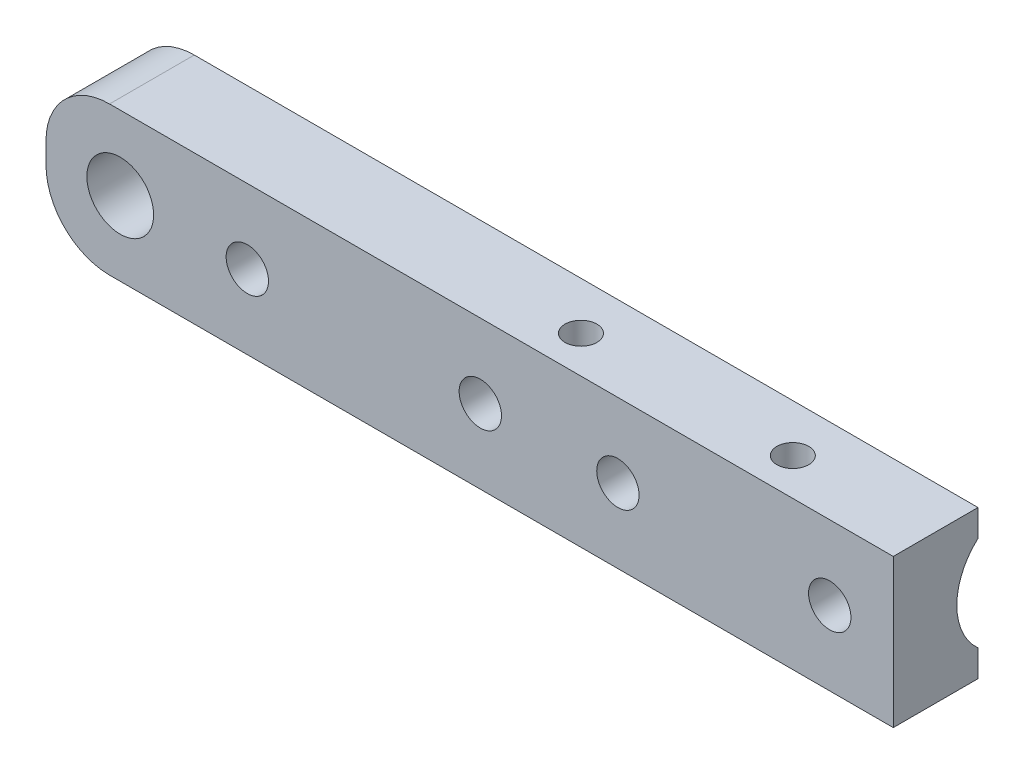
ISO-10303-21;
HEADER;
FILE_DESCRIPTION(('STEP AP214'),'2;1');
FILE_NAME('part.step','',(''),(''),'','','');
FILE_SCHEMA(('AUTOMOTIVE_DESIGN { 1 0 10303 214 1 1 1 1 }'));
ENDSEC;
DATA;
#1=APPLICATION_CONTEXT('core data for automotive mechanical design processes');
#2=APPLICATION_PROTOCOL_DEFINITION('international standard','automotive_design',2000,#1);
#3=PRODUCT_CONTEXT('',#1,'mechanical');
#4=PRODUCT('Part','Part','',(#3));
#5=PRODUCT_RELATED_PRODUCT_CATEGORY('part','',(#4));
#6=PRODUCT_DEFINITION_FORMATION('','',#4);
#7=PRODUCT_DEFINITION_CONTEXT('part definition',#1,'design');
#8=PRODUCT_DEFINITION('design','',#6,#7);
#9=PRODUCT_DEFINITION_SHAPE('','',#8);
#10=(LENGTH_UNIT() NAMED_UNIT(*) SI_UNIT(.MILLI.,.METRE.));
#11=(NAMED_UNIT(*) PLANE_ANGLE_UNIT() SI_UNIT($,.RADIAN.));
#12=(NAMED_UNIT(*) SI_UNIT($,.STERADIAN.) SOLID_ANGLE_UNIT());
#13=UNCERTAINTY_MEASURE_WITH_UNIT(LENGTH_MEASURE(1.E-05),#10,'distance_accuracy_value','');
#14=(GEOMETRIC_REPRESENTATION_CONTEXT(3) GLOBAL_UNCERTAINTY_ASSIGNED_CONTEXT((#13)) GLOBAL_UNIT_ASSIGNED_CONTEXT((#10,
#11,#12)) REPRESENTATION_CONTEXT('',''));
#15=CARTESIAN_POINT('',(0.,0.,0.));
#16=DIRECTION('',(0.,0.,1.));
#17=DIRECTION('',(1.,0.,0.));
#18=AXIS2_PLACEMENT_3D('',#15,#16,#17);
#19=CARTESIAN_POINT('',(-11.1252,-11.1125,6.35));
#20=DIRECTION('',(0.,1.,0.));
#21=DIRECTION('',(0.,0.,1.));
#22=AXIS2_PLACEMENT_3D('',#19,#20,#21);
#23=PLANE('',#22);
#24=CARTESIAN_POINT('',(63.5,-11.1125,0.7874));
#25=DIRECTION('',(0.,1.,0.));
#26=DIRECTION('',(0.,0.,1.));
#27=AXIS2_PLACEMENT_3D('',#24,#25,#26);
#28=CIRCLE('',#27,2.38760000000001);
#29=CARTESIAN_POINT('',(63.5,-11.1125,3.17500000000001));
#30=VERTEX_POINT('',#29);
#31=EDGE_CURVE('E260',#30,#30,#28,.F.);
#32=ORIENTED_EDGE('',*,*,#31,.F.);
#33=EDGE_LOOP('',(#32));
#34=FACE_BOUND('',#33,.T.);
#35=DIRECTION('',(1.,0.,0.));
#36=VECTOR('',#35,1.);
#37=CARTESIAN_POINT('',(-11.1252,-11.1125,6.35));
#38=LINE('',#37,#36);
#39=CARTESIAN_POINT('',(-1.6002,-11.1125,6.35));
#40=VERTEX_POINT('',#39);
#41=CARTESIAN_POINT('',(115.8748,-11.1125,6.35));
#42=VERTEX_POINT('',#41);
#43=EDGE_CURVE('E153',#40,#42,#38,.T.);
#44=ORIENTED_EDGE('',*,*,#43,.F.);
#45=DIRECTION('',(0.,0.,-1.));
#46=VECTOR('',#45,1.);
#47=CARTESIAN_POINT('',(-1.6002,-11.1125,6.35));
#48=LINE('',#47,#46);
#49=CARTESIAN_POINT('',(-1.6002,-11.1125,-6.35));
#50=VERTEX_POINT('',#49);
#51=EDGE_CURVE('E174',#40,#50,#48,.T.);
#52=ORIENTED_EDGE('',*,*,#51,.T.);
#53=DIRECTION('',(1.,0.,0.));
#54=VECTOR('',#53,1.);
#55=CARTESIAN_POINT('',(-11.1252,-11.1125,-6.35));
#56=LINE('',#55,#54);
#57=CARTESIAN_POINT('',(115.8748,-11.1125,-6.35));
#58=VERTEX_POINT('',#57);
#59=EDGE_CURVE('E163',#50,#58,#56,.T.);
#60=ORIENTED_EDGE('',*,*,#59,.T.);
#61=DIRECTION('',(0.,0.,-1.));
#62=VECTOR('',#61,1.);
#63=CARTESIAN_POINT('',(115.8748,-11.1125,6.35));
#64=LINE('',#63,#62);
#65=EDGE_CURVE('E171',#42,#58,#64,.T.);
#66=ORIENTED_EDGE('',*,*,#65,.F.);
#67=EDGE_LOOP('',(#44,#52,#60,#66));
#68=FACE_BOUND('',#67,.T.);
#69=CARTESIAN_POINT('',(95.25,-11.1125,0.7874));
#70=DIRECTION('',(0.,1.,0.));
#71=DIRECTION('',(0.,0.,1.));
#72=AXIS2_PLACEMENT_3D('',#69,#70,#71);
#73=CIRCLE('',#72,2.38760000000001);
#74=CARTESIAN_POINT('',(95.25,-11.1125,3.17500000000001));
#75=VERTEX_POINT('',#74);
#76=EDGE_CURVE('E265',#75,#75,#73,.F.);
#77=ORIENTED_EDGE('',*,*,#76,.F.);
#78=EDGE_LOOP('',(#77));
#79=FACE_BOUND('',#78,.T.);
#80=ADVANCED_FACE('F32',(#34,#68,#79),#23,.F.);
#81=CARTESIAN_POINT('',(115.8748,11.1125,6.35));
#82=DIRECTION('',(0.,-1.,0.));
#83=DIRECTION('',(0.,0.,-1.));
#84=AXIS2_PLACEMENT_3D('',#81,#82,#83);
#85=PLANE('',#84);
#86=CARTESIAN_POINT('',(63.5,11.1125,0.7874));
#87=DIRECTION('',(0.,-1.,0.));
#88=DIRECTION('',(0.,0.,-1.));
#89=AXIS2_PLACEMENT_3D('',#86,#87,#88);
#90=CIRCLE('',#89,2.38760000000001);
#91=CARTESIAN_POINT('',(63.5,11.1125,-1.60020000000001));
#92=VERTEX_POINT('',#91);
#93=EDGE_CURVE('E262',#92,#92,#90,.F.);
#94=ORIENTED_EDGE('',*,*,#93,.F.);
#95=EDGE_LOOP('',(#94));
#96=FACE_BOUND('',#95,.T.);
#97=DIRECTION('',(-1.,0.,0.));
#98=VECTOR('',#97,1.);
#99=CARTESIAN_POINT('',(115.8748,11.1125,-6.35));
#100=LINE('',#99,#98);
#101=CARTESIAN_POINT('',(115.8748,11.1125,-6.35));
#102=VERTEX_POINT('',#101);
#103=CARTESIAN_POINT('',(-1.6002,11.1125,-6.35));
#104=VERTEX_POINT('',#103);
#105=EDGE_CURVE('E154',#102,#104,#100,.T.);
#106=ORIENTED_EDGE('',*,*,#105,.T.);
#107=DIRECTION('',(0.,0.,-1.));
#108=VECTOR('',#107,1.);
#109=CARTESIAN_POINT('',(-1.6002,11.1125,6.35));
#110=LINE('',#109,#108);
#111=CARTESIAN_POINT('',(-1.6002,11.1125,6.35));
#112=VERTEX_POINT('',#111);
#113=EDGE_CURVE('E41',#104,#112,#110,.F.);
#114=ORIENTED_EDGE('',*,*,#113,.T.);
#115=DIRECTION('',(-1.,0.,0.));
#116=VECTOR('',#115,1.);
#117=CARTESIAN_POINT('',(115.8748,11.1125,6.35));
#118=LINE('',#117,#116);
#119=CARTESIAN_POINT('',(115.8748,11.1125,6.35));
#120=VERTEX_POINT('',#119);
#121=EDGE_CURVE('E158',#120,#112,#118,.T.);
#122=ORIENTED_EDGE('',*,*,#121,.F.);
#123=DIRECTION('',(0.,0.,-1.));
#124=VECTOR('',#123,1.);
#125=CARTESIAN_POINT('',(115.8748,11.1125,6.35));
#126=LINE('',#125,#124);
#127=EDGE_CURVE('E160',#120,#102,#126,.T.);
#128=ORIENTED_EDGE('',*,*,#127,.T.);
#129=EDGE_LOOP('',(#106,#114,#122,#128));
#130=FACE_BOUND('',#129,.T.);
#131=CARTESIAN_POINT('',(95.25,11.1125,0.7874));
#132=DIRECTION('',(0.,-1.,0.));
#133=DIRECTION('',(0.,0.,-1.));
#134=AXIS2_PLACEMENT_3D('',#131,#132,#133);
#135=CIRCLE('',#134,2.38760000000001);
#136=CARTESIAN_POINT('',(95.25,11.1125,-1.60020000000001));
#137=VERTEX_POINT('',#136);
#138=EDGE_CURVE('E36',#137,#137,#135,.F.);
#139=ORIENTED_EDGE('',*,*,#138,.F.);
#140=EDGE_LOOP('',(#139));
#141=FACE_BOUND('',#140,.T.);
#142=ADVANCED_FACE('F220',(#96,#130,#141),#85,.F.);
#143=CARTESIAN_POINT('',(0.,0.,6.35));
#144=DIRECTION('',(0.,0.,1.));
#145=DIRECTION('',(1.,0.,0.));
#146=AXIS2_PLACEMENT_3D('',#143,#144,#145);
#147=PLANE('',#146);
#148=CARTESIAN_POINT('',(19.05,0.,6.35));
#149=DIRECTION('',(0.,0.,1.));
#150=DIRECTION('',(1.,0.,0.));
#151=AXIS2_PLACEMENT_3D('',#148,#149,#150);
#152=CIRCLE('',#151,3.175);
#153=CARTESIAN_POINT('',(22.225,0.,6.35));
#154=VERTEX_POINT('',#153);
#155=EDGE_CURVE('E132',#154,#154,#152,.T.);
#156=ORIENTED_EDGE('',*,*,#155,.F.);
#157=EDGE_LOOP('',(#156));
#158=FACE_BOUND('',#157,.T.);
#159=CARTESIAN_POINT('',(106.3498,0.,6.35));
#160=DIRECTION('',(0.,0.,1.));
#161=DIRECTION('',(1.,0.,0.));
#162=AXIS2_PLACEMENT_3D('',#159,#160,#161);
#163=CIRCLE('',#162,3.175);
#164=CARTESIAN_POINT('',(109.5248,0.,6.35));
#165=VERTEX_POINT('',#164);
#166=EDGE_CURVE('E140',#165,#165,#163,.T.);
#167=ORIENTED_EDGE('',*,*,#166,.F.);
#168=EDGE_LOOP('',(#167));
#169=FACE_BOUND('',#168,.T.);
#170=DIRECTION('',(0.,-1.,0.));
#171=VECTOR('',#170,1.);
#172=CARTESIAN_POINT('',(-11.1252,11.1125,6.35));
#173=LINE('',#172,#171);
#174=CARTESIAN_POINT('',(-11.1252,1.5875,6.35));
#175=VERTEX_POINT('',#174);
#176=CARTESIAN_POINT('',(-11.1252,-1.5875,6.35));
#177=VERTEX_POINT('',#176);
#178=EDGE_CURVE('E150',#175,#177,#173,.T.);
#179=ORIENTED_EDGE('',*,*,#178,.T.);
#180=CARTESIAN_POINT('',(-1.6002,-1.5875,6.35));
#181=DIRECTION('',(0.,0.,1.));
#182=DIRECTION('',(1.,0.,0.));
#183=AXIS2_PLACEMENT_3D('',#180,#181,#182);
#184=CIRCLE('',#183,9.525);
#185=EDGE_CURVE('E188',#177,#40,#184,.T.);
#186=ORIENTED_EDGE('',*,*,#185,.T.);
#187=ORIENTED_EDGE('',*,*,#43,.T.);
#188=DIRECTION('',(0.,1.,0.));
#189=VECTOR('',#188,1.);
#190=CARTESIAN_POINT('',(115.8748,-11.1125,6.35));
#191=LINE('',#190,#189);
#192=EDGE_CURVE('E156',#42,#120,#191,.T.);
#193=ORIENTED_EDGE('',*,*,#192,.T.);
#194=ORIENTED_EDGE('',*,*,#121,.T.);
#195=CARTESIAN_POINT('',(-1.6002,1.5875,6.35));
#196=DIRECTION('',(0.,0.,1.));
#197=DIRECTION('',(1.,0.,0.));
#198=AXIS2_PLACEMENT_3D('',#195,#196,#197);
#199=CIRCLE('',#198,9.525);
#200=EDGE_CURVE('E186',#112,#175,#199,.T.);
#201=ORIENTED_EDGE('',*,*,#200,.T.);
#202=EDGE_LOOP('',(#179,#186,#187,#193,#194,#201));
#203=FACE_BOUND('',#202,.T.);
#204=CARTESIAN_POINT('',(0.,0.,6.35));
#205=DIRECTION('',(0.,0.,1.));
#206=DIRECTION('',(1.,0.,0.));
#207=AXIS2_PLACEMENT_3D('',#204,#205,#206);
#208=CIRCLE('',#207,5.0038);
#209=CARTESIAN_POINT('',(5.0038,0.,6.35));
#210=VERTEX_POINT('',#209);
#211=EDGE_CURVE('E144',#210,#210,#208,.T.);
#212=ORIENTED_EDGE('',*,*,#211,.F.);
#213=EDGE_LOOP('',(#212));
#214=FACE_BOUND('',#213,.T.);
#215=CARTESIAN_POINT('',(74.5998,0.,6.35));
#216=DIRECTION('',(0.,0.,1.));
#217=DIRECTION('',(1.,0.,0.));
#218=AXIS2_PLACEMENT_3D('',#215,#216,#217);
#219=CIRCLE('',#218,3.17500000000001);
#220=CARTESIAN_POINT('',(77.7748,0.,6.35));
#221=VERTEX_POINT('',#220);
#222=EDGE_CURVE('E135',#221,#221,#219,.T.);
#223=ORIENTED_EDGE('',*,*,#222,.F.);
#224=EDGE_LOOP('',(#223));
#225=FACE_BOUND('',#224,.T.);
#226=CARTESIAN_POINT('',(53.975,0.,6.35));
#227=DIRECTION('',(0.,0.,1.));
#228=DIRECTION('',(1.,0.,0.));
#229=AXIS2_PLACEMENT_3D('',#226,#227,#228);
#230=CIRCLE('',#229,3.175);
#231=CARTESIAN_POINT('',(57.15,0.,6.35));
#232=VERTEX_POINT('',#231);
#233=EDGE_CURVE('E126',#232,#232,#230,.T.);
#234=ORIENTED_EDGE('',*,*,#233,.F.);
#235=EDGE_LOOP('',(#234));
#236=FACE_BOUND('',#235,.T.);
#237=ADVANCED_FACE('F226',(#158,#169,#203,#214,#225,#236),#147,.T.);
#238=CARTESIAN_POINT('',(0.,0.,-6.35));
#239=DIRECTION('',(0.,0.,1.));
#240=DIRECTION('',(1.,0.,0.));
#241=AXIS2_PLACEMENT_3D('',#238,#239,#240);
#242=PLANE('',#241);
#243=CARTESIAN_POINT('',(19.05,0.,-6.35));
#244=DIRECTION('',(0.,0.,1.));
#245=DIRECTION('',(1.,0.,0.));
#246=AXIS2_PLACEMENT_3D('',#243,#244,#245);
#247=CIRCLE('',#246,3.175);
#248=CARTESIAN_POINT('',(22.225,0.,-6.35));
#249=VERTEX_POINT('',#248);
#250=EDGE_CURVE('E129',#249,#249,#247,.T.);
#251=ORIENTED_EDGE('',*,*,#250,.T.);
#252=EDGE_LOOP('',(#251));
#253=FACE_BOUND('',#252,.T.);
#254=DIRECTION('',(0.,1.,0.));
#255=VECTOR('',#254,1.);
#256=CARTESIAN_POINT('',(65.0748,0.,-6.35));
#257=LINE('',#256,#255);
#258=CARTESIAN_POINT('',(65.0748,-7.09951582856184,-6.35));
#259=VERTEX_POINT('',#258);
#260=CARTESIAN_POINT('',(65.0748,7.09951582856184,-6.35));
#261=VERTEX_POINT('',#260);
#262=EDGE_CURVE('E11',#259,#261,#257,.T.);
#263=ORIENTED_EDGE('',*,*,#262,.F.);
#264=DIRECTION('',(1.,0.,0.));
#265=VECTOR('',#264,1.);
#266=CARTESIAN_POINT('',(65.0748,-7.09951582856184,-6.35));
#267=LINE('',#266,#265);
#268=CARTESIAN_POINT('',(115.8748,-7.09951582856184,-6.35));
#269=VERTEX_POINT('',#268);
#270=EDGE_CURVE('E105',#259,#269,#267,.T.);
#271=ORIENTED_EDGE('',*,*,#270,.T.);
#272=DIRECTION('',(0.,1.,0.));
#273=VECTOR('',#272,1.);
#274=CARTESIAN_POINT('',(115.8748,-11.1125,-6.35));
#275=LINE('',#274,#273);
#276=EDGE_CURVE('E165',#58,#269,#275,.T.);
#277=ORIENTED_EDGE('',*,*,#276,.F.);
#278=ORIENTED_EDGE('',*,*,#59,.F.);
#279=CARTESIAN_POINT('',(-1.6002,-1.5875,-6.35));
#280=DIRECTION('',(0.,0.,1.));
#281=DIRECTION('',(1.,0.,0.));
#282=AXIS2_PLACEMENT_3D('',#279,#280,#281);
#283=CIRCLE('',#282,9.525);
#284=CARTESIAN_POINT('',(-11.1252,-1.5875,-6.35));
#285=VERTEX_POINT('',#284);
#286=EDGE_CURVE('E179',#50,#285,#283,.F.);
#287=ORIENTED_EDGE('',*,*,#286,.T.);
#288=DIRECTION('',(0.,-1.,0.));
#289=VECTOR('',#288,1.);
#290=CARTESIAN_POINT('',(-11.1252,11.1125,-6.35));
#291=LINE('',#290,#289);
#292=CARTESIAN_POINT('',(-11.1252,1.5875,-6.35));
#293=VERTEX_POINT('',#292);
#294=EDGE_CURVE('E147',#293,#285,#291,.T.);
#295=ORIENTED_EDGE('',*,*,#294,.F.);
#296=CARTESIAN_POINT('',(-1.6002,1.5875,-6.35));
#297=DIRECTION('',(0.,0.,1.));
#298=DIRECTION('',(1.,0.,0.));
#299=AXIS2_PLACEMENT_3D('',#296,#297,#298);
#300=CIRCLE('',#299,9.525);
#301=EDGE_CURVE('E177',#293,#104,#300,.F.);
#302=ORIENTED_EDGE('',*,*,#301,.T.);
#303=ORIENTED_EDGE('',*,*,#105,.F.);
#304=CARTESIAN_POINT('',(115.8748,7.09951582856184,-6.35));
#305=VERTEX_POINT('',#304);
#306=EDGE_CURVE('E113',#305,#102,#275,.T.);
#307=ORIENTED_EDGE('',*,*,#306,.F.);
#308=DIRECTION('',(1.,0.,0.));
#309=VECTOR('',#308,1.);
#310=CARTESIAN_POINT('',(65.0748,7.09951582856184,-6.35));
#311=LINE('',#310,#309);
#312=EDGE_CURVE('E49',#305,#261,#311,.F.);
#313=ORIENTED_EDGE('',*,*,#312,.T.);
#314=EDGE_LOOP('',(#263,#271,#277,#278,#287,#295,#302,#303,#307,#313));
#315=FACE_BOUND('',#314,.T.);
#316=CARTESIAN_POINT('',(0.,0.,-6.35));
#317=DIRECTION('',(0.,0.,1.));
#318=DIRECTION('',(1.,0.,0.));
#319=AXIS2_PLACEMENT_3D('',#316,#317,#318);
#320=CIRCLE('',#319,5.0038);
#321=CARTESIAN_POINT('',(5.0038,0.,-6.35));
#322=VERTEX_POINT('',#321);
#323=EDGE_CURVE('E143',#322,#322,#320,.T.);
#324=ORIENTED_EDGE('',*,*,#323,.T.);
#325=EDGE_LOOP('',(#324));
#326=FACE_BOUND('',#325,.T.);
#327=CARTESIAN_POINT('',(53.975,0.,-6.35));
#328=DIRECTION('',(0.,0.,1.));
#329=DIRECTION('',(1.,0.,0.));
#330=AXIS2_PLACEMENT_3D('',#327,#328,#329);
#331=CIRCLE('',#330,3.175);
#332=CARTESIAN_POINT('',(57.15,0.,-6.35));
#333=VERTEX_POINT('',#332);
#334=EDGE_CURVE('E116',#333,#333,#331,.T.);
#335=ORIENTED_EDGE('',*,*,#334,.T.);
#336=EDGE_LOOP('',(#335));
#337=FACE_BOUND('',#336,.T.);
#338=ADVANCED_FACE('F110',(#253,#315,#326,#337),#242,.F.);
#339=CARTESIAN_POINT('',(-11.1252,11.1125,6.35));
#340=DIRECTION('',(1.,0.,0.));
#341=DIRECTION('',(0.,0.,-1.));
#342=AXIS2_PLACEMENT_3D('',#339,#340,#341);
#343=PLANE('',#342);
#344=ORIENTED_EDGE('',*,*,#294,.T.);
#345=DIRECTION('',(0.,0.,-1.));
#346=VECTOR('',#345,1.);
#347=CARTESIAN_POINT('',(-11.1252,-1.5875,6.35));
#348=LINE('',#347,#346);
#349=EDGE_CURVE('E184',#285,#177,#348,.F.);
#350=ORIENTED_EDGE('',*,*,#349,.T.);
#351=ORIENTED_EDGE('',*,*,#178,.F.);
#352=DIRECTION('',(0.,0.,-1.));
#353=VECTOR('',#352,1.);
#354=CARTESIAN_POINT('',(-11.1252,1.5875,6.35));
#355=LINE('',#354,#353);
#356=EDGE_CURVE('E181',#175,#293,#355,.T.);
#357=ORIENTED_EDGE('',*,*,#356,.T.);
#358=EDGE_LOOP('',(#344,#350,#351,#357));
#359=FACE_BOUND('',#358,.T.);
#360=ADVANCED_FACE('F234',(#359),#343,.F.);
#361=CARTESIAN_POINT('',(115.8748,-11.1125,6.35));
#362=DIRECTION('',(-1.,0.,0.));
#363=DIRECTION('',(0.,0.,1.));
#364=AXIS2_PLACEMENT_3D('',#361,#362,#363);
#365=PLANE('',#364);
#366=ORIENTED_EDGE('',*,*,#276,.T.);
#367=CARTESIAN_POINT('',(115.8748,0.,-12.7));
#368=DIRECTION('',(1.,0.,0.));
#369=DIRECTION('',(0.,0.,-1.));
#370=AXIS2_PLACEMENT_3D('',#367,#368,#369);
#371=CIRCLE('',#370,9.525);
#372=EDGE_CURVE('E107',#305,#269,#371,.T.);
#373=ORIENTED_EDGE('',*,*,#372,.F.);
#374=ORIENTED_EDGE('',*,*,#306,.T.);
#375=ORIENTED_EDGE('',*,*,#127,.F.);
#376=ORIENTED_EDGE('',*,*,#192,.F.);
#377=ORIENTED_EDGE('',*,*,#65,.T.);
#378=EDGE_LOOP('',(#366,#373,#374,#375,#376,#377));
#379=FACE_BOUND('',#378,.T.);
#380=ADVANCED_FACE('F233',(#379),#365,.F.);
#381=CARTESIAN_POINT('',(0.,0.,6.35));
#382=DIRECTION('',(0.,0.,-1.));
#383=DIRECTION('',(-1.,0.,0.));
#384=AXIS2_PLACEMENT_3D('',#381,#382,#383);
#385=CYLINDRICAL_SURFACE('',#384,5.0038);
#386=ORIENTED_EDGE('',*,*,#211,.T.);
#387=EDGE_LOOP('',(#386));
#388=FACE_BOUND('',#387,.T.);
#389=ORIENTED_EDGE('',*,*,#323,.F.);
#390=EDGE_LOOP('',(#389));
#391=FACE_BOUND('',#390,.T.);
#392=ADVANCED_FACE('F324',(#388,#391),#385,.F.);
#393=CARTESIAN_POINT('',(106.3498,0.,6.35));
#394=DIRECTION('',(0.,0.,-1.));
#395=DIRECTION('',(-1.,0.,0.));
#396=AXIS2_PLACEMENT_3D('',#393,#394,#395);
#397=CYLINDRICAL_SURFACE('',#396,3.175);
#398=CARTESIAN_POINT('',(103.1748,0.,-3.17499999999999));
#399=CARTESIAN_POINT('',(103.174799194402,-0.173238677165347,-3.17499951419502));
#400=CARTESIAN_POINT('',(103.189024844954,-0.346472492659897,-3.17976981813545));
#401=CARTESIAN_POINT('',(103.245377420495,-0.687837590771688,-3.19832957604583));
#402=CARTESIAN_POINT('',(103.287507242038,-0.855968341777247,-3.21211996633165));
#403=CARTESIAN_POINT('',(103.398063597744,-1.18215660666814,-3.24722147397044));
#404=CARTESIAN_POINT('',(103.466446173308,-1.34023044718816,-3.2685200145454));
#405=CARTESIAN_POINT('',(103.627368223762,-1.64266542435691,-3.31646384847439));
#406=CARTESIAN_POINT('',(103.719912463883,-1.78702384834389,-3.34311019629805));
#407=CARTESIAN_POINT('',(103.929896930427,-2.0629298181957,-3.39997750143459));
#408=CARTESIAN_POINT('',(104.048024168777,-2.19393674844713,-3.43028408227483));
#409=CARTESIAN_POINT('',(104.304360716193,-2.43469379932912,-3.49058500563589));
#410=CARTESIAN_POINT('',(104.442574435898,-2.54443923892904,-3.52057927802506));
#411=CARTESIAN_POINT('',(104.740027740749,-2.74264419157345,-3.57780169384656));
#412=CARTESIAN_POINT('',(104.899757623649,-2.83040092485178,-3.6049255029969));
#413=CARTESIAN_POINT('',(105.232759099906,-2.97757492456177,-3.65203405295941));
#414=CARTESIAN_POINT('',(105.406026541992,-3.03700083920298,-3.67202097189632));
#415=CARTESIAN_POINT('',(105.755037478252,-3.12379824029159,-3.70169112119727));
#416=CARTESIAN_POINT('',(105.930500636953,-3.15218269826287,-3.71169895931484));
#417=CARTESIAN_POINT('',(106.283962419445,-3.17925806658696,-3.72123790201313));
#418=CARTESIAN_POINT('',(106.461960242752,-3.17795815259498,-3.72077224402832));
#419=CARTESIAN_POINT('',(106.80679880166,-3.14648819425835,-3.70970127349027));
#420=CARTESIAN_POINT('',(106.973777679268,-3.11764017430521,-3.69956029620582));
#421=CARTESIAN_POINT('',(107.300374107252,-3.0340495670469,-3.6710411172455));
#422=CARTESIAN_POINT('',(107.459990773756,-2.97930387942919,-3.65266192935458));
#423=CARTESIAN_POINT('',(107.770335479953,-2.84460650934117,-3.60940632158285));
#424=CARTESIAN_POINT('',(107.920878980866,-2.76426310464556,-3.58443003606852));
#425=CARTESIAN_POINT('',(108.206765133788,-2.58092291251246,-3.53083626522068));
#426=CARTESIAN_POINT('',(108.342103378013,-2.47791958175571,-3.50221772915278));
#427=CARTESIAN_POINT('',(108.60116582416,-2.2458341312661,-3.44273729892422));
#428=CARTESIAN_POINT('',(108.723914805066,-2.11567125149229,-3.41183628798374));
#429=CARTESIAN_POINT('',(108.946096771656,-1.83622813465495,-3.35257970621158));
#430=CARTESIAN_POINT('',(109.045527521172,-1.68694606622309,-3.32422437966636));
#431=CARTESIAN_POINT('',(109.219035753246,-1.3714336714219,-3.27288182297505));
#432=CARTESIAN_POINT('',(109.292851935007,-1.20504990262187,-3.24995063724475));
#433=CARTESIAN_POINT('',(109.411145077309,-0.861279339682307,-3.21244699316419));
#434=CARTESIAN_POINT('',(109.455632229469,-0.683896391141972,-3.19787163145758));
#435=CARTESIAN_POINT('',(109.512276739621,-0.331418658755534,-3.17920284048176));
#436=CARTESIAN_POINT('',(109.525751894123,-0.156557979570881,-3.17468244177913));
#437=CARTESIAN_POINT('',(109.523743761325,0.192960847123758,-3.17535233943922));
#438=CARTESIAN_POINT('',(109.508265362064,0.367619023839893,-3.18054099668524));
#439=CARTESIAN_POINT('',(109.449832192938,0.706500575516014,-3.19976421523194));
#440=CARTESIAN_POINT('',(109.407686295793,0.870879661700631,-3.21353819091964));
#441=CARTESIAN_POINT('',(109.298125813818,1.19016766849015,-3.24828386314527));
#442=CARTESIAN_POINT('',(109.23070800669,1.34507537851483,-3.26925647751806));
#443=CARTESIAN_POINT('',(109.070551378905,1.64556534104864,-3.31695643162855));
#444=CARTESIAN_POINT('',(108.977193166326,1.79079512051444,-3.34382063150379));
#445=CARTESIAN_POINT('',(108.768533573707,2.06395583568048,-3.40025818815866));
#446=CARTESIAN_POINT('',(108.653225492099,2.19188146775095,-3.42983237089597));
#447=CARTESIAN_POINT('',(108.397742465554,2.432851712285,-3.49006007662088));
#448=CARTESIAN_POINT('',(108.256675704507,2.54495607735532,-3.52070158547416));
#449=CARTESIAN_POINT('',(107.9570752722,2.74401763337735,-3.578225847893));
#450=CARTESIAN_POINT('',(107.798541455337,2.83097461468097,-3.60510857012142));
#451=CARTESIAN_POINT('',(107.468438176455,2.97687025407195,-3.65180906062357));
#452=CARTESIAN_POINT('',(107.296895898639,3.03586556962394,-3.67164109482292));
#453=CARTESIAN_POINT('',(106.94549778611,3.12386556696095,-3.70170607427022));
#454=CARTESIAN_POINT('',(106.765645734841,3.15288375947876,-3.71194334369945));
#455=CARTESIAN_POINT('',(106.41267422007,3.17905219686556,-3.72116798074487));
#456=CARTESIAN_POINT('',(106.239683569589,3.17776306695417,-3.72070629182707));
#457=CARTESIAN_POINT('',(105.896520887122,3.1471942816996,-3.70994718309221));
#458=CARTESIAN_POINT('',(105.726348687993,3.11791629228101,-3.69965034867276));
#459=CARTESIAN_POINT('',(105.396869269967,3.03330550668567,-3.67079135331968));
#460=CARTESIAN_POINT('',(105.237417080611,2.97847812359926,-3.65238988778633));
#461=CARTESIAN_POINT('',(104.929852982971,2.84473448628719,-3.60945433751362));
#462=CARTESIAN_POINT('',(104.781743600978,2.76581288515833,-3.58491889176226));
#463=CARTESIAN_POINT('',(104.494064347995,2.58210269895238,-3.53114517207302));
#464=CARTESIAN_POINT('',(104.355149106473,2.47633567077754,-3.50174840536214));
#465=CARTESIAN_POINT('',(104.096534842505,2.24359115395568,-3.44222843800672));
#466=CARTESIAN_POINT('',(103.97684127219,2.11660766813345,-3.41210503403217));
#467=CARTESIAN_POINT('',(103.755366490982,1.83909194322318,-3.35311653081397));
#468=CARTESIAN_POINT('',(103.654465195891,1.68783480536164,-3.3243462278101));
#469=CARTESIAN_POINT('',(103.479630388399,1.36955960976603,-3.27259978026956));
#470=CARTESIAN_POINT('',(103.405689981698,1.2025455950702,-3.24962215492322));
#471=CARTESIAN_POINT('',(103.289983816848,0.865167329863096,-3.21292489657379));
#472=CARTESIAN_POINT('',(103.246928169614,0.695286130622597,-3.1988375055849));
#473=CARTESIAN_POINT('',(103.18934060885,0.350267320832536,-3.17987657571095));
#474=CARTESIAN_POINT('',(103.174800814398,0.175131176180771,-3.17500049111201));
#475=CARTESIAN_POINT('',(103.1748,0.,-3.17499999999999));
#476=B_SPLINE_CURVE_WITH_KNOTS('',3,(#398,#399,#400,#401,#402,#403,#404,#405,#406,#407,#408,
#409,#410,#411,#412,#413,#414,#415,#416,#417,#418,#419,#420,#421,#422,#423,#424,#425,#426,#427,
#428,#429,#430,#431,#432,#433,#434,#435,#436,#437,#438,#439,#440,#441,#442,#443,#444,#445,#446,
#447,#448,#449,#450,#451,#452,#453,#454,#455,#456,#457,#458,#459,#460,#461,#462,#463,#464,#465,
#466,#467,#468,#469,#470,#471,#472,#473,#474,#475),.UNSPECIFIED.,.T.,.F.,(4,2,2,2,2,2,2,2,2,2,2,
2,2,2,2,2,2,2,2,2,2,2,2,2,2,2,2,2,2,2,2,2,2,2,2,2,2,2,4),(0.,0.519071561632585,1.03819701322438,
1.55645698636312,2.07481924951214,2.60936372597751,3.14402575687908,3.69406121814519,
4.24392866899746,4.77526114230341,5.30642937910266,5.81332424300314,6.32027980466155,
6.83539943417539,7.35066800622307,7.89283745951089,8.43505888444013,8.98265937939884,
9.53006948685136,10.0537512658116,10.5773446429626,11.0857715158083,11.5942632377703,
12.1161301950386,12.638156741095,13.1839024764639,13.7296527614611,14.274292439,
14.8186865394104,15.3351123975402,15.8515075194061,16.3580948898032,16.8647947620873,
17.3936046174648,17.92256420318,18.4721392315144,19.0215736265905,19.5464607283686,
20.0712027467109),.UNSPECIFIED.);
#477=CARTESIAN_POINT('',(103.1748,0.,-3.17499999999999));
#478=VERTEX_POINT('',#477);
#479=EDGE_CURVE('E114',#478,#478,#476,.T.);
#480=ORIENTED_EDGE('',*,*,#479,.F.);
#481=EDGE_LOOP('',(#480));
#482=FACE_BOUND('',#481,.T.);
#483=ORIENTED_EDGE('',*,*,#166,.T.);
#484=EDGE_LOOP('',(#483));
#485=FACE_BOUND('',#484,.T.);
#486=ADVANCED_FACE('F216',(#482,#485),#397,.F.);
#487=CARTESIAN_POINT('',(74.5998,0.,6.35));
#488=DIRECTION('',(0.,0.,-1.));
#489=DIRECTION('',(-1.,0.,0.));
#490=AXIS2_PLACEMENT_3D('',#487,#488,#489);
#491=CYLINDRICAL_SURFACE('',#490,3.17500000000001);
#492=CARTESIAN_POINT('',(71.4248,0.,-3.17499999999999));
#493=CARTESIAN_POINT('',(71.424799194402,-0.173238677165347,-3.17499951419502));
#494=CARTESIAN_POINT('',(71.4390248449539,-0.346472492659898,-3.17976981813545));
#495=CARTESIAN_POINT('',(71.4953774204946,-0.687837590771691,-3.19832957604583));
#496=CARTESIAN_POINT('',(71.5375072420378,-0.855968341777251,-3.21211996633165));
#497=CARTESIAN_POINT('',(71.6480635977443,-1.18215660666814,-3.24722147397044));
#498=CARTESIAN_POINT('',(71.7164461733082,-1.34023044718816,-3.2685200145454));
#499=CARTESIAN_POINT('',(71.8773682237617,-1.64266542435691,-3.31646384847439));
#500=CARTESIAN_POINT('',(71.9699124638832,-1.7870238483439,-3.34311019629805));
#501=CARTESIAN_POINT('',(72.1798969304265,-2.06292981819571,-3.39997750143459));
#502=CARTESIAN_POINT('',(72.298024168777,-2.19393674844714,-3.43028408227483));
#503=CARTESIAN_POINT('',(72.5543607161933,-2.43469379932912,-3.49058500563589));
#504=CARTESIAN_POINT('',(72.692574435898,-2.54443923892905,-3.52057927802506));
#505=CARTESIAN_POINT('',(72.9900277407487,-2.74264419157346,-3.57780169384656));
#506=CARTESIAN_POINT('',(73.1497576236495,-2.83040092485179,-3.6049255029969));
#507=CARTESIAN_POINT('',(73.4827590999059,-2.97757492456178,-3.65203405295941));
#508=CARTESIAN_POINT('',(73.6560265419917,-3.03700083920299,-3.67202097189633));
#509=CARTESIAN_POINT('',(74.005037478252,-3.12379824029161,-3.70169112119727));
#510=CARTESIAN_POINT('',(74.1805006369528,-3.15218269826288,-3.71169895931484));
#511=CARTESIAN_POINT('',(74.5339624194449,-3.17925806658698,-3.72123790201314));
#512=CARTESIAN_POINT('',(74.7119602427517,-3.17795815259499,-3.72077224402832));
#513=CARTESIAN_POINT('',(75.0567988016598,-3.14648819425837,-3.70970127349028));
#514=CARTESIAN_POINT('',(75.2237776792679,-3.11764017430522,-3.69956029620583));
#515=CARTESIAN_POINT('',(75.5503741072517,-3.03404956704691,-3.67104111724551));
#516=CARTESIAN_POINT('',(75.7099907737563,-2.9793038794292,-3.65266192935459));
#517=CARTESIAN_POINT('',(76.0203354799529,-2.84460650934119,-3.60940632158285));
#518=CARTESIAN_POINT('',(76.1708789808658,-2.76426310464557,-3.58443003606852));
#519=CARTESIAN_POINT('',(76.4567651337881,-2.58092291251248,-3.53083626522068));
#520=CARTESIAN_POINT('',(76.5921033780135,-2.47791958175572,-3.50221772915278));
#521=CARTESIAN_POINT('',(76.8511658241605,-2.2458341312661,-3.44273729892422));
#522=CARTESIAN_POINT('',(76.9739148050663,-2.11567125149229,-3.41183628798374));
#523=CARTESIAN_POINT('',(77.1960967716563,-1.83622813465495,-3.35257970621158));
#524=CARTESIAN_POINT('',(77.2955275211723,-1.68694606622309,-3.32422437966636));
#525=CARTESIAN_POINT('',(77.4690357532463,-1.3714336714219,-3.27288182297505));
#526=CARTESIAN_POINT('',(77.5428519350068,-1.20504990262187,-3.24995063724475));
#527=CARTESIAN_POINT('',(77.6611450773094,-0.861279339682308,-3.21244699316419));
#528=CARTESIAN_POINT('',(77.7056322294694,-0.683896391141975,-3.19787163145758));
#529=CARTESIAN_POINT('',(77.762276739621,-0.331418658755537,-3.17920284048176));
#530=CARTESIAN_POINT('',(77.7757518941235,-0.156557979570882,-3.17468244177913));
#531=CARTESIAN_POINT('',(77.7737437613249,0.192960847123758,-3.17535233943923));
#532=CARTESIAN_POINT('',(77.7582653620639,0.367619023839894,-3.18054099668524));
#533=CARTESIAN_POINT('',(77.6998321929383,0.706500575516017,-3.19976421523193));
#534=CARTESIAN_POINT('',(77.6576862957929,0.870879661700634,-3.21353819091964));
#535=CARTESIAN_POINT('',(77.5481258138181,1.19016766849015,-3.24828386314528));
#536=CARTESIAN_POINT('',(77.4807080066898,1.34507537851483,-3.26925647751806));
#537=CARTESIAN_POINT('',(77.3205513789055,1.64556534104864,-3.31695643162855));
#538=CARTESIAN_POINT('',(77.2271931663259,1.79079512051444,-3.34382063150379));
#539=CARTESIAN_POINT('',(77.0185335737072,2.06395583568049,-3.40025818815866));
#540=CARTESIAN_POINT('',(76.9032254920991,2.19188146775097,-3.42983237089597));
#541=CARTESIAN_POINT('',(76.6477424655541,2.43285171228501,-3.49006007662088));
#542=CARTESIAN_POINT('',(76.5066757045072,2.54495607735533,-3.52070158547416));
#543=CARTESIAN_POINT('',(76.2070752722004,2.74401763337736,-3.578225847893));
#544=CARTESIAN_POINT('',(76.0485414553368,2.83097461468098,-3.60510857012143));
#545=CARTESIAN_POINT('',(75.7184381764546,2.97687025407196,-3.65180906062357));
#546=CARTESIAN_POINT('',(75.5468958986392,3.03586556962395,-3.67164109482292));
#547=CARTESIAN_POINT('',(75.1954977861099,3.12386556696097,-3.70170607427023));
#548=CARTESIAN_POINT('',(75.0156457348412,3.15288375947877,-3.71194334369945));
#549=CARTESIAN_POINT('',(74.6626742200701,3.17905219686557,-3.72116798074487));
#550=CARTESIAN_POINT('',(74.4896835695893,3.17776306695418,-3.72070629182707));
#551=CARTESIAN_POINT('',(74.1465208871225,3.14719428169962,-3.70994718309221));
#552=CARTESIAN_POINT('',(73.9763486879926,3.11791629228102,-3.69965034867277));
#553=CARTESIAN_POINT('',(73.6468692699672,3.03330550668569,-3.67079135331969));
#554=CARTESIAN_POINT('',(73.4874170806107,2.97847812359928,-3.65238988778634));
#555=CARTESIAN_POINT('',(73.179852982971,2.84473448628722,-3.60945433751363));
#556=CARTESIAN_POINT('',(73.0317436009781,2.76581288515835,-3.58491889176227));
#557=CARTESIAN_POINT('',(72.7440643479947,2.5821026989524,-3.53114517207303));
#558=CARTESIAN_POINT('',(72.6051491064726,2.47633567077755,-3.50174840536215));
#559=CARTESIAN_POINT('',(72.3465348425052,2.24359115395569,-3.44222843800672));
#560=CARTESIAN_POINT('',(72.2268412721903,2.11660766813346,-3.41210503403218));
#561=CARTESIAN_POINT('',(72.0053664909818,1.83909194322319,-3.35311653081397));
#562=CARTESIAN_POINT('',(71.9044651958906,1.68783480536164,-3.3243462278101));
#563=CARTESIAN_POINT('',(71.7296303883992,1.36955960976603,-3.27259978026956));
#564=CARTESIAN_POINT('',(71.6556899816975,1.20254559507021,-3.24962215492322));
#565=CARTESIAN_POINT('',(71.5399838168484,0.865167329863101,-3.21292489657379));
#566=CARTESIAN_POINT('',(71.4969281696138,0.6952861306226,-3.1988375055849));
#567=CARTESIAN_POINT('',(71.4393406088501,0.350267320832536,-3.17987657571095));
#568=CARTESIAN_POINT('',(71.4248008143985,0.175131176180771,-3.17500049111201));
#569=CARTESIAN_POINT('',(71.4248,0.,-3.17499999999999));
#570=B_SPLINE_CURVE_WITH_KNOTS('',3,(#492,#493,#494,#495,#496,#497,#498,#499,#500,#501,#502,
#503,#504,#505,#506,#507,#508,#509,#510,#511,#512,#513,#514,#515,#516,#517,#518,#519,#520,#521,
#522,#523,#524,#525,#526,#527,#528,#529,#530,#531,#532,#533,#534,#535,#536,#537,#538,#539,#540,
#541,#542,#543,#544,#545,#546,#547,#548,#549,#550,#551,#552,#553,#554,#555,#556,#557,#558,#559,
#560,#561,#562,#563,#564,#565,#566,#567,#568,#569),.UNSPECIFIED.,.T.,.F.,(4,2,2,2,2,2,2,2,2,2,2,
2,2,2,2,2,2,2,2,2,2,2,2,2,2,2,2,2,2,2,2,2,2,2,2,2,2,2,4),(0.,0.519071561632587,1.03819701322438,
1.55645698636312,2.07481924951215,2.60936372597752,3.14402575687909,3.6940612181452,
4.24392866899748,4.77526114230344,5.30642937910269,5.81332424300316,6.32027980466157,
6.83539943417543,7.35066800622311,7.89283745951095,8.43505888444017,8.98265937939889,
9.53006948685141,10.0537512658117,10.5773446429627,11.0857715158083,11.5942632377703,
12.1161301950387,12.6381567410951,13.1839024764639,13.7296527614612,14.274292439,
14.8186865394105,15.3351123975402,15.8515075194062,16.3580948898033,16.8647947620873,
17.3936046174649,17.92256420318,18.4721392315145,19.0215736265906,19.5464607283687,
20.071202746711),.UNSPECIFIED.);
#571=CARTESIAN_POINT('',(71.4248,0.,-3.17499999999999));
#572=VERTEX_POINT('',#571);
#573=EDGE_CURVE('E106',#572,#572,#570,.T.);
#574=ORIENTED_EDGE('',*,*,#573,.F.);
#575=EDGE_LOOP('',(#574));
#576=FACE_BOUND('',#575,.T.);
#577=ORIENTED_EDGE('',*,*,#222,.T.);
#578=EDGE_LOOP('',(#577));
#579=FACE_BOUND('',#578,.T.);
#580=ADVANCED_FACE('F195',(#576,#579),#491,.F.);
#581=CARTESIAN_POINT('',(19.05,0.,6.35));
#582=DIRECTION('',(0.,0.,-1.));
#583=DIRECTION('',(-1.,0.,0.));
#584=AXIS2_PLACEMENT_3D('',#581,#582,#583);
#585=CYLINDRICAL_SURFACE('',#584,3.175);
#586=ORIENTED_EDGE('',*,*,#155,.T.);
#587=EDGE_LOOP('',(#586));
#588=FACE_BOUND('',#587,.T.);
#589=ORIENTED_EDGE('',*,*,#250,.F.);
#590=EDGE_LOOP('',(#589));
#591=FACE_BOUND('',#590,.T.);
#592=ADVANCED_FACE('F209',(#588,#591),#585,.F.);
#593=CARTESIAN_POINT('',(53.975,0.,6.35));
#594=DIRECTION('',(0.,0.,-1.));
#595=DIRECTION('',(-1.,0.,0.));
#596=AXIS2_PLACEMENT_3D('',#593,#594,#595);
#597=CYLINDRICAL_SURFACE('',#596,3.175);
#598=ORIENTED_EDGE('',*,*,#233,.T.);
#599=EDGE_LOOP('',(#598));
#600=FACE_BOUND('',#599,.T.);
#601=ORIENTED_EDGE('',*,*,#334,.F.);
#602=EDGE_LOOP('',(#601));
#603=FACE_BOUND('',#602,.T.);
#604=ADVANCED_FACE('F205',(#600,#603),#597,.F.);
#605=CARTESIAN_POINT('',(-1.6002,-1.5875,6.35));
#606=DIRECTION('',(0.,0.,-1.));
#607=DIRECTION('',(-1.,0.,0.));
#608=AXIS2_PLACEMENT_3D('',#605,#606,#607);
#609=CYLINDRICAL_SURFACE('',#608,9.525);
#610=ORIENTED_EDGE('',*,*,#185,.F.);
#611=ORIENTED_EDGE('',*,*,#349,.F.);
#612=ORIENTED_EDGE('',*,*,#286,.F.);
#613=ORIENTED_EDGE('',*,*,#51,.F.);
#614=EDGE_LOOP('',(#610,#611,#612,#613));
#615=FACE_BOUND('',#614,.T.);
#616=ADVANCED_FACE('F208',(#615),#609,.T.);
#617=CARTESIAN_POINT('',(-1.6002,1.5875,6.35));
#618=DIRECTION('',(0.,0.,-1.));
#619=DIRECTION('',(-1.,0.,0.));
#620=AXIS2_PLACEMENT_3D('',#617,#618,#619);
#621=CYLINDRICAL_SURFACE('',#620,9.525);
#622=ORIENTED_EDGE('',*,*,#200,.F.);
#623=ORIENTED_EDGE('',*,*,#113,.F.);
#624=ORIENTED_EDGE('',*,*,#301,.F.);
#625=ORIENTED_EDGE('',*,*,#356,.F.);
#626=EDGE_LOOP('',(#622,#623,#624,#625));
#627=FACE_BOUND('',#626,.T.);
#628=ADVANCED_FACE('F34',(#627),#621,.T.);
#629=CARTESIAN_POINT('',(65.0748,0.,-12.7));
#630=DIRECTION('',(1.,0.,0.));
#631=DIRECTION('',(0.,0.,-1.));
#632=AXIS2_PLACEMENT_3D('',#629,#630,#631);
#633=PLANE('',#632);
#634=ORIENTED_EDGE('',*,*,#262,.T.);
#635=CARTESIAN_POINT('',(65.0748,0.,-12.7));
#636=DIRECTION('',(1.,0.,0.));
#637=DIRECTION('',(0.,0.,-1.));
#638=AXIS2_PLACEMENT_3D('',#635,#636,#637);
#639=CIRCLE('',#638,9.525);
#640=EDGE_CURVE('E101',#261,#259,#639,.T.);
#641=ORIENTED_EDGE('',*,*,#640,.T.);
#642=EDGE_LOOP('',(#634,#641));
#643=FACE_BOUND('',#642,.T.);
#644=ADVANCED_FACE('F100',(#643),#633,.T.);
#645=CARTESIAN_POINT('',(65.0748,0.,-12.7));
#646=DIRECTION('',(1.,0.,0.));
#647=DIRECTION('',(0.,0.,-1.));
#648=AXIS2_PLACEMENT_3D('',#645,#646,#647);
#649=CYLINDRICAL_SURFACE('',#648,9.525);
#650=ORIENTED_EDGE('',*,*,#573,.T.);
#651=EDGE_LOOP('',(#650));
#652=FACE_BOUND('',#651,.T.);
#653=ORIENTED_EDGE('',*,*,#479,.T.);
#654=EDGE_LOOP('',(#653));
#655=FACE_BOUND('',#654,.T.);
#656=ORIENTED_EDGE('',*,*,#640,.F.);
#657=ORIENTED_EDGE('',*,*,#312,.F.);
#658=ORIENTED_EDGE('',*,*,#372,.T.);
#659=ORIENTED_EDGE('',*,*,#270,.F.);
#660=EDGE_LOOP('',(#656,#657,#658,#659));
#661=FACE_BOUND('',#660,.T.);
#662=ADVANCED_FACE('F104',(#652,#655,#661),#649,.F.);
#663=CARTESIAN_POINT('',(63.5,12.7,0.7874));
#664=DIRECTION('',(0.,-1.,0.));
#665=DIRECTION('',(0.,0.,-1.));
#666=AXIS2_PLACEMENT_3D('',#663,#664,#665);
#667=CYLINDRICAL_SURFACE('',#666,2.38760000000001);
#668=ORIENTED_EDGE('',*,*,#93,.T.);
#669=EDGE_LOOP('',(#668));
#670=FACE_BOUND('',#669,.T.);
#671=ORIENTED_EDGE('',*,*,#31,.T.);
#672=EDGE_LOOP('',(#671));
#673=FACE_BOUND('',#672,.T.);
#674=ADVANCED_FACE('F202',(#670,#673),#667,.F.);
#675=CARTESIAN_POINT('',(95.25,12.7,0.7874));
#676=DIRECTION('',(0.,-1.,0.));
#677=DIRECTION('',(0.,0.,-1.));
#678=AXIS2_PLACEMENT_3D('',#675,#676,#677);
#679=CYLINDRICAL_SURFACE('',#678,2.38760000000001);
#680=ORIENTED_EDGE('',*,*,#138,.T.);
#681=EDGE_LOOP('',(#680));
#682=FACE_BOUND('',#681,.T.);
#683=ORIENTED_EDGE('',*,*,#76,.T.);
#684=EDGE_LOOP('',(#683));
#685=FACE_BOUND('',#684,.T.);
#686=ADVANCED_FACE('F273',(#682,#685),#679,.F.);
#687=CLOSED_SHELL('',(#80,#142,#237,#338,#360,#380,#392,#486,#580,#592,#604,#616,#628,#644,#662,
#674,#686));
#688=MANIFOLD_SOLID_BREP('B2',#687);
#689=ADVANCED_BREP_SHAPE_REPRESENTATION('',(#18,#688),#14);
#690=SHAPE_DEFINITION_REPRESENTATION(#9,#689);
ENDSEC;
END-ISO-10303-21;
